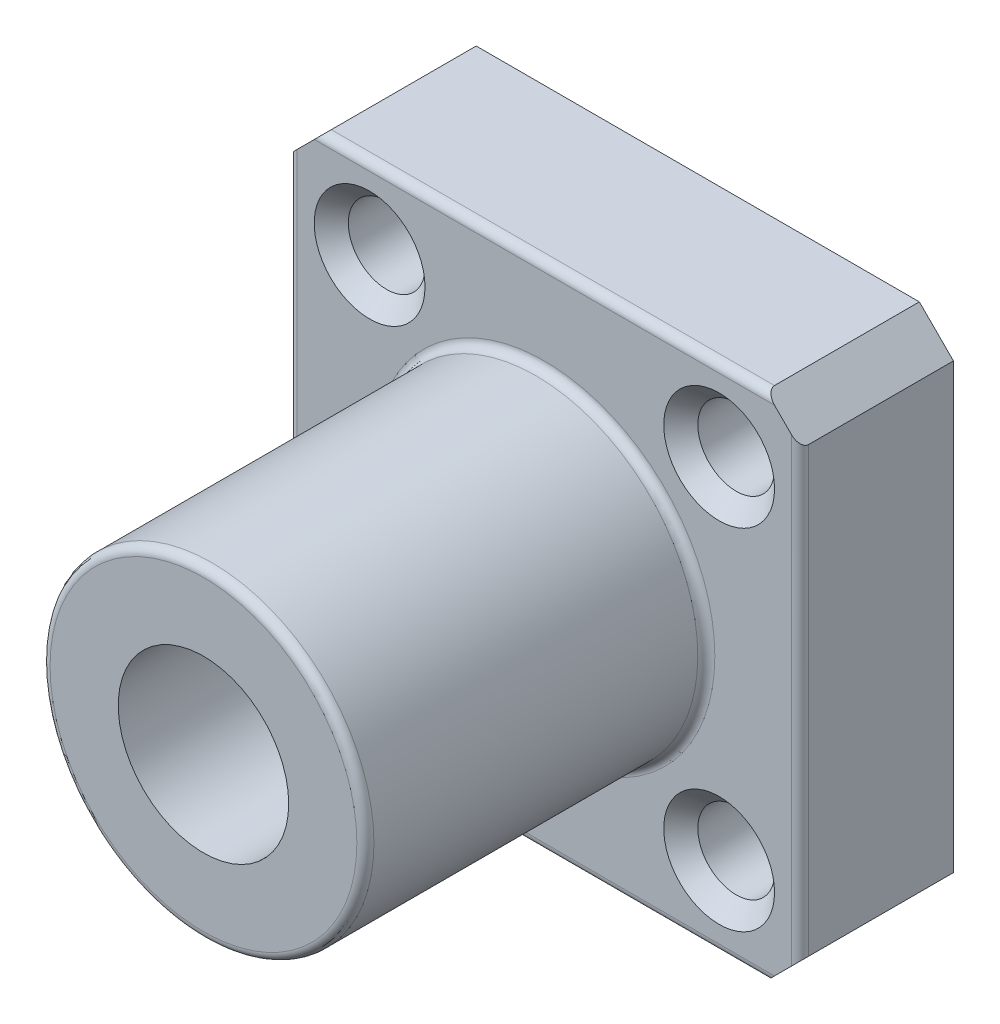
ISO-10303-21;
HEADER;
FILE_DESCRIPTION(('STEP AP214'),'2;1');
FILE_NAME('part.step','',(''),(''),'','','');
FILE_SCHEMA(('AUTOMOTIVE_DESIGN { 1 0 10303 214 1 1 1 1 }'));
ENDSEC;
DATA;
#1=APPLICATION_CONTEXT('core data for automotive mechanical design processes');
#2=APPLICATION_PROTOCOL_DEFINITION('international standard','automotive_design',2000,#1);
#3=PRODUCT_CONTEXT('',#1,'mechanical');
#4=PRODUCT('Part','Part','',(#3));
#5=PRODUCT_RELATED_PRODUCT_CATEGORY('part','',(#4));
#6=PRODUCT_DEFINITION_FORMATION('','',#4);
#7=PRODUCT_DEFINITION_CONTEXT('part definition',#1,'design');
#8=PRODUCT_DEFINITION('design','',#6,#7);
#9=PRODUCT_DEFINITION_SHAPE('','',#8);
#10=(LENGTH_UNIT() NAMED_UNIT(*) SI_UNIT(.MILLI.,.METRE.));
#11=(NAMED_UNIT(*) PLANE_ANGLE_UNIT() SI_UNIT($,.RADIAN.));
#12=(NAMED_UNIT(*) SI_UNIT($,.STERADIAN.) SOLID_ANGLE_UNIT());
#13=UNCERTAINTY_MEASURE_WITH_UNIT(LENGTH_MEASURE(1.E-05),#10,'distance_accuracy_value','');
#14=(GEOMETRIC_REPRESENTATION_CONTEXT(3) GLOBAL_UNCERTAINTY_ASSIGNED_CONTEXT((#13)) GLOBAL_UNIT_ASSIGNED_CONTEXT((#10,
#11,#12)) REPRESENTATION_CONTEXT('',''));
#15=CARTESIAN_POINT('',(0.,0.,0.));
#16=DIRECTION('',(0.,0.,1.));
#17=DIRECTION('',(1.,0.,0.));
#18=AXIS2_PLACEMENT_3D('',#15,#16,#17);
#19=CARTESIAN_POINT('',(0.,0.,9.));
#20=DIRECTION('',(0.,0.,1.));
#21=DIRECTION('',(1.,0.,0.));
#22=AXIS2_PLACEMENT_3D('',#19,#20,#21);
#23=PLANE('',#22);
#24=CARTESIAN_POINT('',(0.,0.,9.));
#25=DIRECTION('',(0.,0.,1.));
#26=DIRECTION('',(1.,0.,0.));
#27=AXIS2_PLACEMENT_3D('',#24,#25,#26);
#28=CIRCLE('',#27,10.);
#29=CARTESIAN_POINT('',(10.,0.,9.));
#30=VERTEX_POINT('',#29);
#31=EDGE_CURVE('E203',#30,#30,#28,.F.);
#32=ORIENTED_EDGE('',*,*,#31,.T.);
#33=EDGE_LOOP('',(#32));
#34=FACE_BOUND('',#33,.T.);
#35=DIRECTION('',(1.,0.,0.));
#36=VECTOR('',#35,1.);
#37=CARTESIAN_POINT('',(15.,-14.5,9.));
#38=LINE('',#37,#36);
#39=CARTESIAN_POINT('',(-13.5,-14.5,9.));
#40=VERTEX_POINT('',#39);
#41=CARTESIAN_POINT('',(13.5,-14.5,9.));
#42=VERTEX_POINT('',#41);
#43=EDGE_CURVE('E193',#40,#42,#38,.T.);
#44=ORIENTED_EDGE('',*,*,#43,.T.);
#45=DIRECTION('',(-0.707106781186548,-0.707106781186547,0.));
#46=VECTOR('',#45,1.);
#47=CARTESIAN_POINT('',(14.,-14.,9.));
#48=LINE('',#47,#46);
#49=CARTESIAN_POINT('',(14.5,-13.5,9.));
#50=VERTEX_POINT('',#49);
#51=EDGE_CURVE('E149',#42,#50,#48,.F.);
#52=ORIENTED_EDGE('',*,*,#51,.T.);
#53=DIRECTION('',(0.,1.,0.));
#54=VECTOR('',#53,1.);
#55=CARTESIAN_POINT('',(14.5,15.,9.));
#56=LINE('',#55,#54);
#57=CARTESIAN_POINT('',(14.5,13.5,9.));
#58=VERTEX_POINT('',#57);
#59=EDGE_CURVE('E204',#50,#58,#56,.T.);
#60=ORIENTED_EDGE('',*,*,#59,.T.);
#61=DIRECTION('',(0.707106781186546,-0.707106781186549,0.));
#62=VECTOR('',#61,1.);
#63=CARTESIAN_POINT('',(14.,14.,9.));
#64=LINE('',#63,#62);
#65=CARTESIAN_POINT('',(13.5,14.5,9.));
#66=VERTEX_POINT('',#65);
#67=EDGE_CURVE('E148',#58,#66,#64,.F.);
#68=ORIENTED_EDGE('',*,*,#67,.T.);
#69=DIRECTION('',(-1.,0.,0.));
#70=VECTOR('',#69,1.);
#71=CARTESIAN_POINT('',(-15.,14.5,9.));
#72=LINE('',#71,#70);
#73=CARTESIAN_POINT('',(-13.5,14.5,9.));
#74=VERTEX_POINT('',#73);
#75=EDGE_CURVE('E171',#66,#74,#72,.T.);
#76=ORIENTED_EDGE('',*,*,#75,.T.);
#77=DIRECTION('',(0.707106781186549,0.707106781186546,0.));
#78=VECTOR('',#77,1.);
#79=CARTESIAN_POINT('',(-14.,14.,9.));
#80=LINE('',#79,#78);
#81=CARTESIAN_POINT('',(-14.5,13.5,9.));
#82=VERTEX_POINT('',#81);
#83=EDGE_CURVE('E178',#74,#82,#80,.F.);
#84=ORIENTED_EDGE('',*,*,#83,.T.);
#85=DIRECTION('',(0.,-1.,0.));
#86=VECTOR('',#85,1.);
#87=CARTESIAN_POINT('',(-14.5,-15.,9.));
#88=LINE('',#87,#86);
#89=CARTESIAN_POINT('',(-14.5,-13.5,9.));
#90=VERTEX_POINT('',#89);
#91=EDGE_CURVE('E180',#82,#90,#88,.T.);
#92=ORIENTED_EDGE('',*,*,#91,.T.);
#93=DIRECTION('',(-0.707106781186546,0.707106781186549,0.));
#94=VECTOR('',#93,1.);
#95=CARTESIAN_POINT('',(-14.,-14.,9.));
#96=LINE('',#95,#94);
#97=EDGE_CURVE('E153',#90,#40,#96,.F.);
#98=ORIENTED_EDGE('',*,*,#97,.T.);
#99=EDGE_LOOP('',(#44,#52,#60,#68,#76,#84,#92,#98));
#100=FACE_BOUND('',#99,.T.);
#101=CARTESIAN_POINT('',(-10.2530483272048,10.253048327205,9.));
#102=DIRECTION('',(0.,0.,1.));
#103=DIRECTION('',(1.,0.,0.));
#104=AXIS2_PLACEMENT_3D('',#101,#102,#103);
#105=CIRCLE('',#104,3.24999999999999);
#106=CARTESIAN_POINT('',(-7.00304832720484,10.253048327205,9.));
#107=VERTEX_POINT('',#106);
#108=EDGE_CURVE('E239',#107,#107,#105,.F.);
#109=ORIENTED_EDGE('',*,*,#108,.T.);
#110=EDGE_LOOP('',(#109));
#111=FACE_BOUND('',#110,.T.);
#112=CARTESIAN_POINT('',(-10.2530483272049,-10.2530483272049,9.));
#113=DIRECTION('',(0.,0.,1.));
#114=DIRECTION('',(1.,0.,0.));
#115=AXIS2_PLACEMENT_3D('',#112,#113,#114);
#116=CIRCLE('',#115,3.25);
#117=CARTESIAN_POINT('',(-7.00304832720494,-10.2530483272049,9.));
#118=VERTEX_POINT('',#117);
#119=EDGE_CURVE('E245',#118,#118,#116,.F.);
#120=ORIENTED_EDGE('',*,*,#119,.T.);
#121=EDGE_LOOP('',(#120));
#122=FACE_BOUND('',#121,.T.);
#123=CARTESIAN_POINT('',(10.2530483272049,-10.253048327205,9.));
#124=DIRECTION('',(0.,0.,1.));
#125=DIRECTION('',(1.,0.,0.));
#126=AXIS2_PLACEMENT_3D('',#123,#124,#125);
#127=CIRCLE('',#126,3.24999999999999);
#128=CARTESIAN_POINT('',(13.5030483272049,-10.253048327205,9.));
#129=VERTEX_POINT('',#128);
#130=EDGE_CURVE('E251',#129,#129,#127,.F.);
#131=ORIENTED_EDGE('',*,*,#130,.T.);
#132=EDGE_LOOP('',(#131));
#133=FACE_BOUND('',#132,.T.);
#134=CARTESIAN_POINT('',(10.2530483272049,10.2530483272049,9.));
#135=DIRECTION('',(0.,0.,1.));
#136=DIRECTION('',(1.,0.,0.));
#137=AXIS2_PLACEMENT_3D('',#134,#135,#136);
#138=CIRCLE('',#137,3.25);
#139=CARTESIAN_POINT('',(13.5030483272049,10.2530483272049,9.));
#140=VERTEX_POINT('',#139);
#141=EDGE_CURVE('E257',#140,#140,#138,.F.);
#142=ORIENTED_EDGE('',*,*,#141,.T.);
#143=EDGE_LOOP('',(#142));
#144=FACE_BOUND('',#143,.T.);
#145=ADVANCED_FACE('F33',(#34,#100,#111,#122,#133,#144),#23,.T.);
#146=CARTESIAN_POINT('',(15.,15.,9.));
#147=DIRECTION('',(-1.,0.,0.));
#148=DIRECTION('',(0.,-1.,0.));
#149=AXIS2_PLACEMENT_3D('',#146,#147,#148);
#150=PLANE('',#149);
#151=DIRECTION('',(0.,1.,0.));
#152=VECTOR('',#151,1.);
#153=CARTESIAN_POINT('',(15.,-15.,8.5));
#154=LINE('',#153,#152);
#155=CARTESIAN_POINT('',(15.,13.,8.5));
#156=VERTEX_POINT('',#155);
#157=CARTESIAN_POINT('',(15.,-13.,8.5));
#158=VERTEX_POINT('',#157);
#159=EDGE_CURVE('E127',#156,#158,#154,.F.);
#160=ORIENTED_EDGE('',*,*,#159,.T.);
#161=DIRECTION('',(0.,0.,-1.));
#162=VECTOR('',#161,1.);
#163=CARTESIAN_POINT('',(15.,-13.,9.));
#164=LINE('',#163,#162);
#165=CARTESIAN_POINT('',(15.,-13.,0.));
#166=VERTEX_POINT('',#165);
#167=EDGE_CURVE('E133',#158,#166,#164,.T.);
#168=ORIENTED_EDGE('',*,*,#167,.T.);
#169=DIRECTION('',(0.,1.,0.));
#170=VECTOR('',#169,1.);
#171=CARTESIAN_POINT('',(15.,15.,0.));
#172=LINE('',#171,#170);
#173=CARTESIAN_POINT('',(15.,13.,0.));
#174=VERTEX_POINT('',#173);
#175=EDGE_CURVE('E130',#166,#174,#172,.T.);
#176=ORIENTED_EDGE('',*,*,#175,.T.);
#177=DIRECTION('',(0.,0.,1.));
#178=VECTOR('',#177,1.);
#179=CARTESIAN_POINT('',(15.,13.,9.));
#180=LINE('',#179,#178);
#181=EDGE_CURVE('E123',#174,#156,#180,.T.);
#182=ORIENTED_EDGE('',*,*,#181,.T.);
#183=EDGE_LOOP('',(#160,#168,#176,#182));
#184=FACE_BOUND('',#183,.T.);
#185=ADVANCED_FACE('F125',(#184),#150,.F.);
#186=CARTESIAN_POINT('',(-15.,15.,9.));
#187=DIRECTION('',(0.,-1.,0.));
#188=DIRECTION('',(0.,0.,-1.));
#189=AXIS2_PLACEMENT_3D('',#186,#187,#188);
#190=PLANE('',#189);
#191=DIRECTION('',(-1.,0.,0.));
#192=VECTOR('',#191,1.);
#193=CARTESIAN_POINT('',(15.,15.,8.5));
#194=LINE('',#193,#192);
#195=CARTESIAN_POINT('',(-13.,15.,8.5));
#196=VERTEX_POINT('',#195);
#197=CARTESIAN_POINT('',(13.,15.,8.5));
#198=VERTEX_POINT('',#197);
#199=EDGE_CURVE('E134',#196,#198,#194,.F.);
#200=ORIENTED_EDGE('',*,*,#199,.T.);
#201=DIRECTION('',(0.,0.,-1.));
#202=VECTOR('',#201,1.);
#203=CARTESIAN_POINT('',(13.,15.,9.));
#204=LINE('',#203,#202);
#205=CARTESIAN_POINT('',(13.,15.,0.));
#206=VERTEX_POINT('',#205);
#207=EDGE_CURVE('E166',#198,#206,#204,.T.);
#208=ORIENTED_EDGE('',*,*,#207,.T.);
#209=DIRECTION('',(-1.,0.,0.));
#210=VECTOR('',#209,1.);
#211=CARTESIAN_POINT('',(-15.,15.,0.));
#212=LINE('',#211,#210);
#213=CARTESIAN_POINT('',(-13.,15.,0.));
#214=VERTEX_POINT('',#213);
#215=EDGE_CURVE('E269',#206,#214,#212,.T.);
#216=ORIENTED_EDGE('',*,*,#215,.T.);
#217=DIRECTION('',(0.,0.,1.));
#218=VECTOR('',#217,1.);
#219=CARTESIAN_POINT('',(-13.,15.,9.));
#220=LINE('',#219,#218);
#221=EDGE_CURVE('E53',#214,#196,#220,.T.);
#222=ORIENTED_EDGE('',*,*,#221,.T.);
#223=EDGE_LOOP('',(#200,#208,#216,#222));
#224=FACE_BOUND('',#223,.T.);
#225=ADVANCED_FACE('F310',(#224),#190,.F.);
#226=CARTESIAN_POINT('',(-15.,15.,9.));
#227=DIRECTION('',(1.,0.,0.));
#228=DIRECTION('',(0.,1.,0.));
#229=AXIS2_PLACEMENT_3D('',#226,#227,#228);
#230=PLANE('',#229);
#231=DIRECTION('',(0.,-1.,0.));
#232=VECTOR('',#231,1.);
#233=CARTESIAN_POINT('',(-15.,15.,0.));
#234=LINE('',#233,#232);
#235=CARTESIAN_POINT('',(-15.,13.,0.));
#236=VERTEX_POINT('',#235);
#237=CARTESIAN_POINT('',(-15.,-13.,0.));
#238=VERTEX_POINT('',#237);
#239=EDGE_CURVE('E266',#236,#238,#234,.T.);
#240=ORIENTED_EDGE('',*,*,#239,.T.);
#241=DIRECTION('',(0.,0.,1.));
#242=VECTOR('',#241,1.);
#243=CARTESIAN_POINT('',(-15.,-13.,9.));
#244=LINE('',#243,#242);
#245=CARTESIAN_POINT('',(-15.,-13.,8.5));
#246=VERTEX_POINT('',#245);
#247=EDGE_CURVE('E159',#238,#246,#244,.T.);
#248=ORIENTED_EDGE('',*,*,#247,.T.);
#249=DIRECTION('',(0.,-1.,0.));
#250=VECTOR('',#249,1.);
#251=CARTESIAN_POINT('',(-15.,15.,8.5));
#252=LINE('',#251,#250);
#253=CARTESIAN_POINT('',(-15.,13.,8.5));
#254=VERTEX_POINT('',#253);
#255=EDGE_CURVE('E143',#246,#254,#252,.F.);
#256=ORIENTED_EDGE('',*,*,#255,.T.);
#257=DIRECTION('',(0.,0.,-1.));
#258=VECTOR('',#257,1.);
#259=CARTESIAN_POINT('',(-15.,13.,9.));
#260=LINE('',#259,#258);
#261=EDGE_CURVE('E151',#254,#236,#260,.T.);
#262=ORIENTED_EDGE('',*,*,#261,.T.);
#263=EDGE_LOOP('',(#240,#248,#256,#262));
#264=FACE_BOUND('',#263,.T.);
#265=ADVANCED_FACE('F313',(#264),#230,.F.);
#266=CARTESIAN_POINT('',(-15.,-15.,9.));
#267=DIRECTION('',(0.,1.,0.));
#268=DIRECTION('',(0.,0.,1.));
#269=AXIS2_PLACEMENT_3D('',#266,#267,#268);
#270=PLANE('',#269);
#271=DIRECTION('',(1.,0.,0.));
#272=VECTOR('',#271,1.);
#273=CARTESIAN_POINT('',(-15.,-15.,0.));
#274=LINE('',#273,#272);
#275=CARTESIAN_POINT('',(-13.,-15.,0.));
#276=VERTEX_POINT('',#275);
#277=CARTESIAN_POINT('',(13.,-15.,0.));
#278=VERTEX_POINT('',#277);
#279=EDGE_CURVE('E263',#276,#278,#274,.T.);
#280=ORIENTED_EDGE('',*,*,#279,.T.);
#281=DIRECTION('',(0.,0.,1.));
#282=VECTOR('',#281,1.);
#283=CARTESIAN_POINT('',(13.,-15.,9.));
#284=LINE('',#283,#282);
#285=CARTESIAN_POINT('',(13.,-15.,8.5));
#286=VERTEX_POINT('',#285);
#287=EDGE_CURVE('E210',#278,#286,#284,.T.);
#288=ORIENTED_EDGE('',*,*,#287,.T.);
#289=DIRECTION('',(1.,0.,0.));
#290=VECTOR('',#289,1.);
#291=CARTESIAN_POINT('',(-15.,-15.,8.5));
#292=LINE('',#291,#290);
#293=CARTESIAN_POINT('',(-13.,-15.,8.5));
#294=VERTEX_POINT('',#293);
#295=EDGE_CURVE('E144',#286,#294,#292,.F.);
#296=ORIENTED_EDGE('',*,*,#295,.T.);
#297=DIRECTION('',(0.,0.,-1.));
#298=VECTOR('',#297,1.);
#299=CARTESIAN_POINT('',(-13.,-15.,9.));
#300=LINE('',#299,#298);
#301=EDGE_CURVE('E209',#294,#276,#300,.T.);
#302=ORIENTED_EDGE('',*,*,#301,.T.);
#303=EDGE_LOOP('',(#280,#288,#296,#302));
#304=FACE_BOUND('',#303,.T.);
#305=ADVANCED_FACE('F297',(#304),#270,.F.);
#306=CARTESIAN_POINT('',(0.,0.,0.));
#307=DIRECTION('',(0.,0.,1.));
#308=DIRECTION('',(1.,0.,0.));
#309=AXIS2_PLACEMENT_3D('',#306,#307,#308);
#310=PLANE('',#309);
#311=CARTESIAN_POINT('',(-10.2530483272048,10.253048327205,0.));
#312=DIRECTION('',(0.,0.,-1.));
#313=DIRECTION('',(0.,-1.,0.));
#314=AXIS2_PLACEMENT_3D('',#311,#312,#313);
#315=CIRCLE('',#314,2.25);
#316=CARTESIAN_POINT('',(-10.2530483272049,8.00304832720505,0.));
#317=VERTEX_POINT('',#316);
#318=EDGE_CURVE('E287',#317,#317,#315,.T.);
#319=ORIENTED_EDGE('',*,*,#318,.F.);
#320=EDGE_LOOP('',(#319));
#321=FACE_BOUND('',#320,.T.);
#322=CARTESIAN_POINT('',(-10.2530483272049,-10.2530483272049,0.));
#323=DIRECTION('',(0.,0.,-1.));
#324=DIRECTION('',(1.,0.,0.));
#325=AXIS2_PLACEMENT_3D('',#322,#323,#324);
#326=CIRCLE('',#325,2.25);
#327=CARTESIAN_POINT('',(-8.00304832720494,-10.2530483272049,0.));
#328=VERTEX_POINT('',#327);
#329=EDGE_CURVE('E284',#328,#328,#326,.T.);
#330=ORIENTED_EDGE('',*,*,#329,.F.);
#331=EDGE_LOOP('',(#330));
#332=FACE_BOUND('',#331,.T.);
#333=CARTESIAN_POINT('',(10.2530483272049,-10.253048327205,0.));
#334=DIRECTION('',(0.,0.,-1.));
#335=DIRECTION('',(0.,1.,0.));
#336=AXIS2_PLACEMENT_3D('',#333,#334,#335);
#337=CIRCLE('',#336,2.25);
#338=CARTESIAN_POINT('',(10.2530483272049,-8.00304832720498,0.));
#339=VERTEX_POINT('',#338);
#340=EDGE_CURVE('E281',#339,#339,#337,.T.);
#341=ORIENTED_EDGE('',*,*,#340,.F.);
#342=EDGE_LOOP('',(#341));
#343=FACE_BOUND('',#342,.T.);
#344=CARTESIAN_POINT('',(10.2530483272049,10.2530483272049,0.));
#345=DIRECTION('',(0.,0.,-1.));
#346=DIRECTION('',(-1.,0.,0.));
#347=AXIS2_PLACEMENT_3D('',#344,#345,#346);
#348=CIRCLE('',#347,2.25);
#349=CARTESIAN_POINT('',(8.00304832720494,10.2530483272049,0.));
#350=VERTEX_POINT('',#349);
#351=EDGE_CURVE('E276',#350,#350,#348,.T.);
#352=ORIENTED_EDGE('',*,*,#351,.F.);
#353=EDGE_LOOP('',(#352));
#354=FACE_BOUND('',#353,.T.);
#355=CARTESIAN_POINT('',(0.,0.,0.));
#356=DIRECTION('',(0.,0.,1.));
#357=DIRECTION('',(1.,0.,0.));
#358=AXIS2_PLACEMENT_3D('',#355,#356,#357);
#359=CIRCLE('',#358,5.);
#360=CARTESIAN_POINT('',(5.,0.,0.));
#361=VERTEX_POINT('',#360);
#362=EDGE_CURVE('E272',#361,#361,#359,.T.);
#363=ORIENTED_EDGE('',*,*,#362,.T.);
#364=EDGE_LOOP('',(#363));
#365=FACE_BOUND('',#364,.T.);
#366=ORIENTED_EDGE('',*,*,#175,.F.);
#367=DIRECTION('',(0.707106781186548,0.707106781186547,0.));
#368=VECTOR('',#367,1.);
#369=CARTESIAN_POINT('',(15.,-13.,0.));
#370=LINE('',#369,#368);
#371=EDGE_CURVE('E214',#166,#278,#370,.F.);
#372=ORIENTED_EDGE('',*,*,#371,.T.);
#373=ORIENTED_EDGE('',*,*,#279,.F.);
#374=DIRECTION('',(0.707106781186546,-0.707106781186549,0.));
#375=VECTOR('',#374,1.);
#376=CARTESIAN_POINT('',(-13.,-15.,0.));
#377=LINE('',#376,#375);
#378=EDGE_CURVE('E216',#276,#238,#377,.F.);
#379=ORIENTED_EDGE('',*,*,#378,.T.);
#380=ORIENTED_EDGE('',*,*,#239,.F.);
#381=DIRECTION('',(-0.707106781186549,-0.707106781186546,0.));
#382=VECTOR('',#381,1.);
#383=CARTESIAN_POINT('',(-15.,13.,0.));
#384=LINE('',#383,#382);
#385=EDGE_CURVE('E220',#236,#214,#384,.F.);
#386=ORIENTED_EDGE('',*,*,#385,.T.);
#387=ORIENTED_EDGE('',*,*,#215,.F.);
#388=DIRECTION('',(-0.707106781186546,0.707106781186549,0.));
#389=VECTOR('',#388,1.);
#390=CARTESIAN_POINT('',(13.,15.,0.));
#391=LINE('',#390,#389);
#392=EDGE_CURVE('E218',#206,#174,#391,.F.);
#393=ORIENTED_EDGE('',*,*,#392,.T.);
#394=EDGE_LOOP('',(#366,#372,#373,#379,#380,#386,#387,#393));
#395=FACE_BOUND('',#394,.T.);
#396=ADVANCED_FACE('F293',(#321,#332,#343,#354,#365,#395),#310,.F.);
#397=CARTESIAN_POINT('',(0.,0.,29.));
#398=DIRECTION('',(0.,0.,-1.));
#399=DIRECTION('',(-1.,0.,0.));
#400=AXIS2_PLACEMENT_3D('',#397,#398,#399);
#401=CYLINDRICAL_SURFACE('',#400,9.5);
#402=CARTESIAN_POINT('',(0.,0.,9.5));
#403=DIRECTION('',(0.,0.,1.));
#404=DIRECTION('',(1.,0.,0.));
#405=AXIS2_PLACEMENT_3D('',#402,#403,#404);
#406=CIRCLE('',#405,9.5);
#407=CARTESIAN_POINT('',(9.5,0.,9.5));
#408=VERTEX_POINT('',#407);
#409=EDGE_CURVE('E181',#408,#408,#406,.T.);
#410=ORIENTED_EDGE('',*,*,#409,.T.);
#411=EDGE_LOOP('',(#410));
#412=FACE_BOUND('',#411,.T.);
#413=CARTESIAN_POINT('',(0.,0.,28.5));
#414=DIRECTION('',(0.,0.,1.));
#415=DIRECTION('',(1.,0.,0.));
#416=AXIS2_PLACEMENT_3D('',#413,#414,#415);
#417=CIRCLE('',#416,9.5);
#418=CARTESIAN_POINT('',(9.5,0.,28.5));
#419=VERTEX_POINT('',#418);
#420=EDGE_CURVE('E236',#419,#419,#417,.F.);
#421=ORIENTED_EDGE('',*,*,#420,.T.);
#422=EDGE_LOOP('',(#421));
#423=FACE_BOUND('',#422,.T.);
#424=ADVANCED_FACE('F296',(#412,#423),#401,.T.);
#425=CARTESIAN_POINT('',(0.,0.,29.));
#426=DIRECTION('',(0.,0.,1.));
#427=DIRECTION('',(1.,0.,0.));
#428=AXIS2_PLACEMENT_3D('',#425,#426,#427);
#429=PLANE('',#428);
#430=CARTESIAN_POINT('',(0.,0.,29.));
#431=DIRECTION('',(0.,0.,1.));
#432=DIRECTION('',(1.,0.,0.));
#433=AXIS2_PLACEMENT_3D('',#430,#431,#432);
#434=CIRCLE('',#433,9.);
#435=CARTESIAN_POINT('',(9.,0.,29.));
#436=VERTEX_POINT('',#435);
#437=EDGE_CURVE('E227',#436,#436,#434,.T.);
#438=ORIENTED_EDGE('',*,*,#437,.T.);
#439=EDGE_LOOP('',(#438));
#440=FACE_BOUND('',#439,.T.);
#441=CARTESIAN_POINT('',(0.,0.,29.));
#442=DIRECTION('',(0.,0.,1.));
#443=DIRECTION('',(1.,0.,0.));
#444=AXIS2_PLACEMENT_3D('',#441,#442,#443);
#445=CIRCLE('',#444,5.);
#446=CARTESIAN_POINT('',(5.,0.,29.));
#447=VERTEX_POINT('',#446);
#448=EDGE_CURVE('E273',#447,#447,#445,.T.);
#449=ORIENTED_EDGE('',*,*,#448,.F.);
#450=EDGE_LOOP('',(#449));
#451=FACE_BOUND('',#450,.T.);
#452=ADVANCED_FACE('F499',(#440,#451),#429,.T.);
#453=CARTESIAN_POINT('',(0.,0.,0.));
#454=DIRECTION('',(0.,0.,1.));
#455=DIRECTION('',(1.,0.,0.));
#456=AXIS2_PLACEMENT_3D('',#453,#454,#455);
#457=CYLINDRICAL_SURFACE('',#456,5.);
#458=ORIENTED_EDGE('',*,*,#362,.F.);
#459=EDGE_LOOP('',(#458));
#460=FACE_BOUND('',#459,.T.);
#461=ORIENTED_EDGE('',*,*,#448,.T.);
#462=EDGE_LOOP('',(#461));
#463=FACE_BOUND('',#462,.T.);
#464=ADVANCED_FACE('F490',(#460,#463),#457,.F.);
#465=CARTESIAN_POINT('',(10.2530483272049,10.2530483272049,29.));
#466=DIRECTION('',(0.,0.,-1.));
#467=DIRECTION('',(-1.,0.,0.));
#468=AXIS2_PLACEMENT_3D('',#465,#466,#467);
#469=CYLINDRICAL_SURFACE('',#468,2.25);
#470=CARTESIAN_POINT('',(10.2530483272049,10.2530483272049,8.));
#471=DIRECTION('',(0.,0.,1.));
#472=DIRECTION('',(1.,0.,0.));
#473=AXIS2_PLACEMENT_3D('',#470,#471,#472);
#474=CIRCLE('',#473,2.25);
#475=CARTESIAN_POINT('',(12.5030483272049,10.2530483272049,8.));
#476=VERTEX_POINT('',#475);
#477=EDGE_CURVE('E260',#476,#476,#474,.T.);
#478=ORIENTED_EDGE('',*,*,#477,.T.);
#479=EDGE_LOOP('',(#478));
#480=FACE_BOUND('',#479,.T.);
#481=ORIENTED_EDGE('',*,*,#351,.T.);
#482=EDGE_LOOP('',(#481));
#483=FACE_BOUND('',#482,.T.);
#484=ADVANCED_FACE('F349',(#480,#483),#469,.F.);
#485=CARTESIAN_POINT('',(10.2530483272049,10.2530483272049,8.));
#486=DIRECTION('',(0.,0.,1.));
#487=DIRECTION('',(1.,0.,0.));
#488=AXIS2_PLACEMENT_3D('',#485,#486,#487);
#489=CONICAL_SURFACE('',#488,2.25,0.785398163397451);
#490=ORIENTED_EDGE('',*,*,#141,.F.);
#491=EDGE_LOOP('',(#490));
#492=FACE_BOUND('',#491,.T.);
#493=ORIENTED_EDGE('',*,*,#477,.F.);
#494=EDGE_LOOP('',(#493));
#495=FACE_BOUND('',#494,.T.);
#496=ADVANCED_FACE('F345',(#492,#495),#489,.F.);
#497=CARTESIAN_POINT('',(10.2530483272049,-10.253048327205,29.));
#498=DIRECTION('',(0.,0.,-1.));
#499=DIRECTION('',(-1.,0.,0.));
#500=AXIS2_PLACEMENT_3D('',#497,#498,#499);
#501=CYLINDRICAL_SURFACE('',#500,2.25);
#502=CARTESIAN_POINT('',(10.2530483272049,-10.253048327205,8.00000000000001));
#503=DIRECTION('',(0.,0.,1.));
#504=DIRECTION('',(1.,0.,0.));
#505=AXIS2_PLACEMENT_3D('',#502,#503,#504);
#506=CIRCLE('',#505,2.25);
#507=CARTESIAN_POINT('',(12.5030483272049,-10.253048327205,8.00000000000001));
#508=VERTEX_POINT('',#507);
#509=EDGE_CURVE('E254',#508,#508,#506,.T.);
#510=ORIENTED_EDGE('',*,*,#509,.T.);
#511=EDGE_LOOP('',(#510));
#512=FACE_BOUND('',#511,.T.);
#513=ORIENTED_EDGE('',*,*,#340,.T.);
#514=EDGE_LOOP('',(#513));
#515=FACE_BOUND('',#514,.T.);
#516=ADVANCED_FACE('F348',(#512,#515),#501,.F.);
#517=CARTESIAN_POINT('',(-10.2530483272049,-10.2530483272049,29.));
#518=DIRECTION('',(0.,0.,-1.));
#519=DIRECTION('',(-1.,0.,0.));
#520=AXIS2_PLACEMENT_3D('',#517,#518,#519);
#521=CYLINDRICAL_SURFACE('',#520,2.25);
#522=CARTESIAN_POINT('',(-10.2530483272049,-10.2530483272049,8.));
#523=DIRECTION('',(0.,0.,1.));
#524=DIRECTION('',(1.,0.,0.));
#525=AXIS2_PLACEMENT_3D('',#522,#523,#524);
#526=CIRCLE('',#525,2.25);
#527=CARTESIAN_POINT('',(-8.00304832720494,-10.2530483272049,8.));
#528=VERTEX_POINT('',#527);
#529=EDGE_CURVE('E248',#528,#528,#526,.T.);
#530=ORIENTED_EDGE('',*,*,#529,.T.);
#531=EDGE_LOOP('',(#530));
#532=FACE_BOUND('',#531,.T.);
#533=ORIENTED_EDGE('',*,*,#329,.T.);
#534=EDGE_LOOP('',(#533));
#535=FACE_BOUND('',#534,.T.);
#536=ADVANCED_FACE('F460',(#532,#535),#521,.F.);
#537=CARTESIAN_POINT('',(-10.2530483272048,10.253048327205,29.));
#538=DIRECTION('',(0.,0.,-1.));
#539=DIRECTION('',(-1.,0.,0.));
#540=AXIS2_PLACEMENT_3D('',#537,#538,#539);
#541=CYLINDRICAL_SURFACE('',#540,2.25);
#542=CARTESIAN_POINT('',(-10.2530483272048,10.253048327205,8.00000000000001));
#543=DIRECTION('',(0.,0.,1.));
#544=DIRECTION('',(1.,0.,0.));
#545=AXIS2_PLACEMENT_3D('',#542,#543,#544);
#546=CIRCLE('',#545,2.25);
#547=CARTESIAN_POINT('',(-8.00304832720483,10.253048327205,8.00000000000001));
#548=VERTEX_POINT('',#547);
#549=EDGE_CURVE('E242',#548,#548,#546,.T.);
#550=ORIENTED_EDGE('',*,*,#549,.T.);
#551=EDGE_LOOP('',(#550));
#552=FACE_BOUND('',#551,.T.);
#553=ORIENTED_EDGE('',*,*,#318,.T.);
#554=EDGE_LOOP('',(#553));
#555=FACE_BOUND('',#554,.T.);
#556=ADVANCED_FACE('F291',(#552,#555),#541,.F.);
#557=CARTESIAN_POINT('',(10.2530483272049,-10.253048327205,8.00000000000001));
#558=DIRECTION('',(0.,0.,1.));
#559=DIRECTION('',(1.,0.,0.));
#560=AXIS2_PLACEMENT_3D('',#557,#558,#559);
#561=CONICAL_SURFACE('',#560,2.25,0.785398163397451);
#562=ORIENTED_EDGE('',*,*,#130,.F.);
#563=EDGE_LOOP('',(#562));
#564=FACE_BOUND('',#563,.T.);
#565=ORIENTED_EDGE('',*,*,#509,.F.);
#566=EDGE_LOOP('',(#565));
#567=FACE_BOUND('',#566,.T.);
#568=ADVANCED_FACE('F351',(#564,#567),#561,.F.);
#569=CARTESIAN_POINT('',(-10.2530483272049,-10.2530483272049,8.));
#570=DIRECTION('',(0.,0.,1.));
#571=DIRECTION('',(1.,0.,0.));
#572=AXIS2_PLACEMENT_3D('',#569,#570,#571);
#573=CONICAL_SURFACE('',#572,2.25,0.785398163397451);
#574=ORIENTED_EDGE('',*,*,#119,.F.);
#575=EDGE_LOOP('',(#574));
#576=FACE_BOUND('',#575,.T.);
#577=ORIENTED_EDGE('',*,*,#529,.F.);
#578=EDGE_LOOP('',(#577));
#579=FACE_BOUND('',#578,.T.);
#580=ADVANCED_FACE('F354',(#576,#579),#573,.F.);
#581=CARTESIAN_POINT('',(-10.2530483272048,10.253048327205,8.00000000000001));
#582=DIRECTION('',(0.,0.,1.));
#583=DIRECTION('',(1.,0.,0.));
#584=AXIS2_PLACEMENT_3D('',#581,#582,#583);
#585=CONICAL_SURFACE('',#584,2.25,0.785398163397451);
#586=ORIENTED_EDGE('',*,*,#108,.F.);
#587=EDGE_LOOP('',(#586));
#588=FACE_BOUND('',#587,.T.);
#589=ORIENTED_EDGE('',*,*,#549,.F.);
#590=EDGE_LOOP('',(#589));
#591=FACE_BOUND('',#590,.T.);
#592=ADVANCED_FACE('F358',(#588,#591),#585,.F.);
#593=CARTESIAN_POINT('',(0.,0.,9.5));
#594=DIRECTION('',(0.,0.,1.));
#595=DIRECTION('',(1.,0.,0.));
#596=AXIS2_PLACEMENT_3D('',#593,#594,#595);
#597=TOROIDAL_SURFACE('',#596,10.,0.5);
#598=ORIENTED_EDGE('',*,*,#31,.F.);
#599=EDGE_LOOP('',(#598));
#600=FACE_BOUND('',#599,.T.);
#601=ORIENTED_EDGE('',*,*,#409,.F.);
#602=EDGE_LOOP('',(#601));
#603=FACE_BOUND('',#602,.T.);
#604=ADVANCED_FACE('F362',(#600,#603),#597,.F.);
#605=CARTESIAN_POINT('',(0.,0.,28.5));
#606=DIRECTION('',(0.,0.,1.));
#607=DIRECTION('',(1.,0.,0.));
#608=AXIS2_PLACEMENT_3D('',#605,#606,#607);
#609=TOROIDAL_SURFACE('',#608,9.,0.5);
#610=ORIENTED_EDGE('',*,*,#420,.F.);
#611=EDGE_LOOP('',(#610));
#612=FACE_BOUND('',#611,.T.);
#613=ORIENTED_EDGE('',*,*,#437,.F.);
#614=EDGE_LOOP('',(#613));
#615=FACE_BOUND('',#614,.T.);
#616=ADVANCED_FACE('F366',(#612,#615),#609,.T.);
#617=CARTESIAN_POINT('',(0.,14.5,8.5));
#618=DIRECTION('',(1.,0.,0.));
#619=DIRECTION('',(0.,0.,-1.));
#620=AXIS2_PLACEMENT_3D('',#617,#618,#619);
#621=CYLINDRICAL_SURFACE('',#620,0.5);
#622=ORIENTED_EDGE('',*,*,#75,.F.);
#623=CARTESIAN_POINT('',(13.5,14.5,8.5));
#624=DIRECTION('',(-0.707106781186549,-0.707106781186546,0.));
#625=DIRECTION('',(0.707106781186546,-0.707106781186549,0.));
#626=AXIS2_PLACEMENT_3D('',#623,#624,#625);
#627=ELLIPSE('',#626,0.707106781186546,0.5);
#628=EDGE_CURVE('E11',#66,#198,#627,.T.);
#629=ORIENTED_EDGE('',*,*,#628,.T.);
#630=ORIENTED_EDGE('',*,*,#199,.F.);
#631=CARTESIAN_POINT('',(-13.5,14.5,8.5));
#632=DIRECTION('',(0.707106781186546,-0.707106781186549,0.));
#633=DIRECTION('',(0.707106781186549,0.707106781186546,0.));
#634=AXIS2_PLACEMENT_3D('',#631,#632,#633);
#635=ELLIPSE('',#634,0.707106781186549,0.5);
#636=EDGE_CURVE('E41',#196,#74,#635,.T.);
#637=ORIENTED_EDGE('',*,*,#636,.T.);
#638=EDGE_LOOP('',(#622,#629,#630,#637));
#639=FACE_BOUND('',#638,.T.);
#640=ADVANCED_FACE('F170',(#639),#621,.T.);
#641=CARTESIAN_POINT('',(-14.5,0.,8.5));
#642=DIRECTION('',(0.,1.,0.));
#643=DIRECTION('',(-1.,0.,0.));
#644=AXIS2_PLACEMENT_3D('',#641,#642,#643);
#645=CYLINDRICAL_SURFACE('',#644,0.5);
#646=ORIENTED_EDGE('',*,*,#255,.F.);
#647=CARTESIAN_POINT('',(-14.5,-13.5,8.5));
#648=DIRECTION('',(0.707106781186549,0.707106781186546,0.));
#649=DIRECTION('',(-0.707106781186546,0.707106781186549,0.));
#650=AXIS2_PLACEMENT_3D('',#647,#648,#649);
#651=ELLIPSE('',#650,0.707106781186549,0.5);
#652=EDGE_CURVE('E163',#246,#90,#651,.T.);
#653=ORIENTED_EDGE('',*,*,#652,.T.);
#654=ORIENTED_EDGE('',*,*,#91,.F.);
#655=CARTESIAN_POINT('',(-14.5,13.5,8.5));
#656=DIRECTION('',(0.707106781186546,-0.707106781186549,0.));
#657=DIRECTION('',(0.707106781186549,0.707106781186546,0.));
#658=AXIS2_PLACEMENT_3D('',#655,#656,#657);
#659=ELLIPSE('',#658,0.707106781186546,0.5);
#660=EDGE_CURVE('E161',#82,#254,#659,.T.);
#661=ORIENTED_EDGE('',*,*,#660,.T.);
#662=EDGE_LOOP('',(#646,#653,#654,#661));
#663=FACE_BOUND('',#662,.T.);
#664=ADVANCED_FACE('F373',(#663),#645,.T.);
#665=CARTESIAN_POINT('',(14.5,0.,8.5));
#666=DIRECTION('',(0.,-1.,0.));
#667=DIRECTION('',(1.,0.,0.));
#668=AXIS2_PLACEMENT_3D('',#665,#666,#667);
#669=CYLINDRICAL_SURFACE('',#668,0.5);
#670=ORIENTED_EDGE('',*,*,#59,.F.);
#671=CARTESIAN_POINT('',(14.5,-13.5,8.5));
#672=DIRECTION('',(-0.707106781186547,0.707106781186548,0.));
#673=DIRECTION('',(-0.707106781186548,-0.707106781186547,0.));
#674=AXIS2_PLACEMENT_3D('',#671,#672,#673);
#675=ELLIPSE('',#674,0.707106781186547,0.5);
#676=EDGE_CURVE('E142',#50,#158,#675,.T.);
#677=ORIENTED_EDGE('',*,*,#676,.T.);
#678=ORIENTED_EDGE('',*,*,#159,.F.);
#679=CARTESIAN_POINT('',(14.5,13.5,8.5));
#680=DIRECTION('',(-0.707106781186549,-0.707106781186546,0.));
#681=DIRECTION('',(0.707106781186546,-0.707106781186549,0.));
#682=AXIS2_PLACEMENT_3D('',#679,#680,#681);
#683=ELLIPSE('',#682,0.707106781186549,0.5);
#684=EDGE_CURVE('E139',#156,#58,#683,.T.);
#685=ORIENTED_EDGE('',*,*,#684,.T.);
#686=EDGE_LOOP('',(#670,#677,#678,#685));
#687=FACE_BOUND('',#686,.T.);
#688=ADVANCED_FACE('F138',(#687),#669,.T.);
#689=CARTESIAN_POINT('',(0.,-14.5,8.5));
#690=DIRECTION('',(-1.,0.,0.));
#691=DIRECTION('',(0.,0.,1.));
#692=AXIS2_PLACEMENT_3D('',#689,#690,#691);
#693=CYLINDRICAL_SURFACE('',#692,0.5);
#694=ORIENTED_EDGE('',*,*,#295,.F.);
#695=CARTESIAN_POINT('',(13.5,-14.5,8.5));
#696=DIRECTION('',(-0.707106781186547,0.707106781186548,0.));
#697=DIRECTION('',(-0.707106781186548,-0.707106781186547,0.));
#698=AXIS2_PLACEMENT_3D('',#695,#696,#697);
#699=ELLIPSE('',#698,0.707106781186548,0.5);
#700=EDGE_CURVE('E185',#286,#42,#699,.T.);
#701=ORIENTED_EDGE('',*,*,#700,.T.);
#702=ORIENTED_EDGE('',*,*,#43,.F.);
#703=CARTESIAN_POINT('',(-13.5,-14.5,8.5));
#704=DIRECTION('',(0.707106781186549,0.707106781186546,0.));
#705=DIRECTION('',(-0.707106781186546,0.707106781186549,0.));
#706=AXIS2_PLACEMENT_3D('',#703,#704,#705);
#707=ELLIPSE('',#706,0.707106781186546,0.5);
#708=EDGE_CURVE('E188',#40,#294,#707,.T.);
#709=ORIENTED_EDGE('',*,*,#708,.T.);
#710=EDGE_LOOP('',(#694,#701,#702,#709));
#711=FACE_BOUND('',#710,.T.);
#712=ADVANCED_FACE('F200',(#711),#693,.T.);
#713=CARTESIAN_POINT('',(15.,-13.,9.));
#714=DIRECTION('',(-0.707106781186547,0.707106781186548,0.));
#715=DIRECTION('',(0.,0.,-1.));
#716=AXIS2_PLACEMENT_3D('',#713,#714,#715);
#717=PLANE('',#716);
#718=ORIENTED_EDGE('',*,*,#700,.F.);
#719=ORIENTED_EDGE('',*,*,#287,.F.);
#720=ORIENTED_EDGE('',*,*,#371,.F.);
#721=ORIENTED_EDGE('',*,*,#167,.F.);
#722=ORIENTED_EDGE('',*,*,#676,.F.);
#723=ORIENTED_EDGE('',*,*,#51,.F.);
#724=EDGE_LOOP('',(#718,#719,#720,#721,#722,#723));
#725=FACE_BOUND('',#724,.T.);
#726=ADVANCED_FACE('F319',(#725),#717,.F.);
#727=CARTESIAN_POINT('',(-13.,-15.,9.));
#728=DIRECTION('',(0.707106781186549,0.707106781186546,0.));
#729=DIRECTION('',(0.,0.,-1.));
#730=AXIS2_PLACEMENT_3D('',#727,#728,#729);
#731=PLANE('',#730);
#732=ORIENTED_EDGE('',*,*,#652,.F.);
#733=ORIENTED_EDGE('',*,*,#247,.F.);
#734=ORIENTED_EDGE('',*,*,#378,.F.);
#735=ORIENTED_EDGE('',*,*,#301,.F.);
#736=ORIENTED_EDGE('',*,*,#708,.F.);
#737=ORIENTED_EDGE('',*,*,#97,.F.);
#738=EDGE_LOOP('',(#732,#733,#734,#735,#736,#737));
#739=FACE_BOUND('',#738,.T.);
#740=ADVANCED_FACE('F207',(#739),#731,.F.);
#741=CARTESIAN_POINT('',(13.,15.,9.));
#742=DIRECTION('',(-0.707106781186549,-0.707106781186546,0.));
#743=DIRECTION('',(0.,0.,-1.));
#744=AXIS2_PLACEMENT_3D('',#741,#742,#743);
#745=PLANE('',#744);
#746=ORIENTED_EDGE('',*,*,#684,.F.);
#747=ORIENTED_EDGE('',*,*,#181,.F.);
#748=ORIENTED_EDGE('',*,*,#392,.F.);
#749=ORIENTED_EDGE('',*,*,#207,.F.);
#750=ORIENTED_EDGE('',*,*,#628,.F.);
#751=ORIENTED_EDGE('',*,*,#67,.F.);
#752=EDGE_LOOP('',(#746,#747,#748,#749,#750,#751));
#753=FACE_BOUND('',#752,.T.);
#754=ADVANCED_FACE('F147',(#753),#745,.F.);
#755=CARTESIAN_POINT('',(-15.,13.,9.));
#756=DIRECTION('',(0.707106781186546,-0.707106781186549,0.));
#757=DIRECTION('',(0.,0.,-1.));
#758=AXIS2_PLACEMENT_3D('',#755,#756,#757);
#759=PLANE('',#758);
#760=ORIENTED_EDGE('',*,*,#636,.F.);
#761=ORIENTED_EDGE('',*,*,#221,.F.);
#762=ORIENTED_EDGE('',*,*,#385,.F.);
#763=ORIENTED_EDGE('',*,*,#261,.F.);
#764=ORIENTED_EDGE('',*,*,#660,.F.);
#765=ORIENTED_EDGE('',*,*,#83,.F.);
#766=EDGE_LOOP('',(#760,#761,#762,#763,#764,#765));
#767=FACE_BOUND('',#766,.T.);
#768=ADVANCED_FACE('F35',(#767),#759,.F.);
#769=CLOSED_SHELL('',(#145,#185,#225,#265,#305,#396,#424,#452,#464,#484,#496,#516,#536,#556,
#568,#580,#592,#604,#616,#640,#664,#688,#712,#726,#740,#754,#768));
#770=MANIFOLD_SOLID_BREP('B2',#769);
#771=ADVANCED_BREP_SHAPE_REPRESENTATION('',(#18,#770),#14);
#772=SHAPE_DEFINITION_REPRESENTATION(#9,#771);
ENDSEC;
END-ISO-10303-21;
